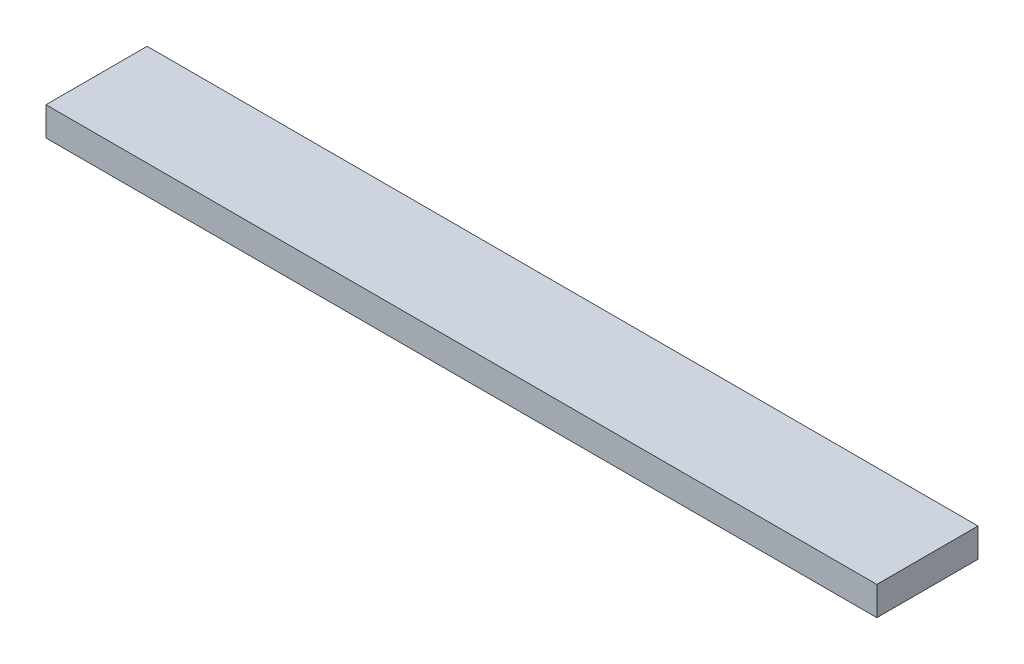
from build123d import *

# Parameters (mm, degrees)
SKIZZE1_W               = 821.261032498
SKIZZE1_H               = 28.516008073
LINEAR_AUSTRAGEN1_DEPTH = 100


with BuildPart() as part:
    # Skizze1 → Linear austragen1 (new body)
    with BuildSketch(Plane.XY):
        with Locations((410.630516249, 14.258004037)):
            Rectangle(SKIZZE1_W, SKIZZE1_H)
    extrude(amount=LINEAR_AUSTRAGEN1_DEPTH)


solid = part.part
